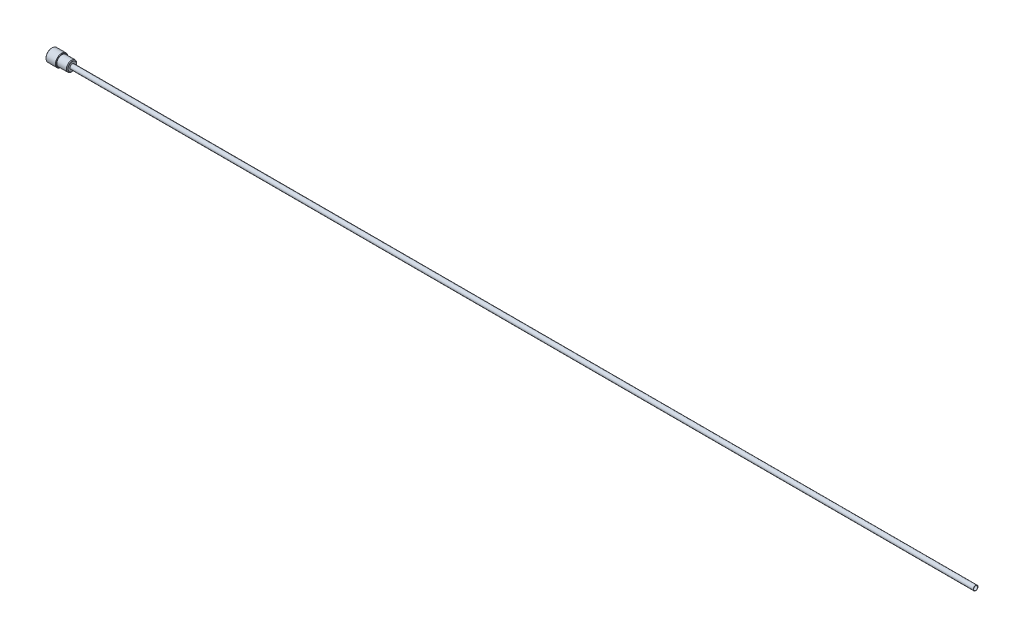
from build123d import *

# Parameters (mm, degrees)
CHAMFER3_SIZE      = 0.2
CHAMFER2_SIZE      = 0.3
CUT_EXTRUDE1_REACH = 452.02


with BuildPart() as part:
    # Sketch1 → Revolve1 (revolve)
    with BuildSketch(Plane.XY, mode=Mode.PRIVATE) as revolve1_sk:
        Polygon((10, 2.05), (9.9, 2.05), (9.640192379, 2.5), (5, 2.5), (5, 3), (0, 3), (0, 0.9652), (450, 0.9652), (450, 1.143), (10, 1.143), align=None)
    revolve(revolve1_sk.sketch.rotate(Axis((-22.212185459, 0, 0), (1, 0, 0)), 90), axis=Axis((-22.212185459, 0, 0), (1, 0, 0)))

    # Chamfer3
    chamfer3_edges = [part.edges().sort_by_distance(p)[0] for p in [
        (0, 0, -3),
        (5, 0, -3),
    ]]
    chamfer(chamfer3_edges, length=CHAMFER3_SIZE)

    # Sketch6 → Cut-Revolve1 (revolve, cut)
    with BuildSketch(Plane.XY, mode=Mode.PRIVATE) as cut_revolve1_sk:
        Polygon((0, 0), (0, 2), (3, 2), (4.201721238, 0), align=None)
    revolve(cut_revolve1_sk.sketch.rotate(Axis((-11.68186824, 0, 0), (1, 0, 0)), 90), axis=Axis((-11.68186824, 0, 0), (1, 0, 0)), mode=Mode.SUBTRACT)

    # Chamfer2
    chamfer2_edges = [part.edges().sort_by_distance(p)[0] for p in [
        (0, 0, -2),
    ]]
    chamfer(chamfer2_edges, length=CHAMFER2_SIZE)

    # Cut-Extrude1: up to this cone (the profile starts inside it)
    cut_extrude1_end = Plane(origin=(0, 0, 0), z_dir=(-1, 0, 0)).offset(-4.201720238) * Cone(1.664e-06, 771.750627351, 463.714558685, align=(Align.CENTER, Align.CENTER, Align.MIN), mode=Mode.PRIVATE)
    # Sketch7 → Cut-Extrude1 (cut, up to the surface)
    with BuildSketch(Plane.ZY, mode=Mode.PRIVATE) as cut_extrude1_sk1:
        Polygon((-2.309401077, 0), (-1.154700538, -2), (1.154700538, -2), (2.309401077, 0), (1.154700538, 2), (-1.154700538, 2), align=None)
    cut_extrude1_tool1 = extrude(cut_extrude1_sk1.sketch, amount=-CUT_EXTRUDE1_REACH, mode=Mode.PRIVATE) & cut_extrude1_end
    add(cut_extrude1_tool1.solids().sort_by_distance((0, 0, 0))[0], mode=Mode.SUBTRACT)


solid = part.part
